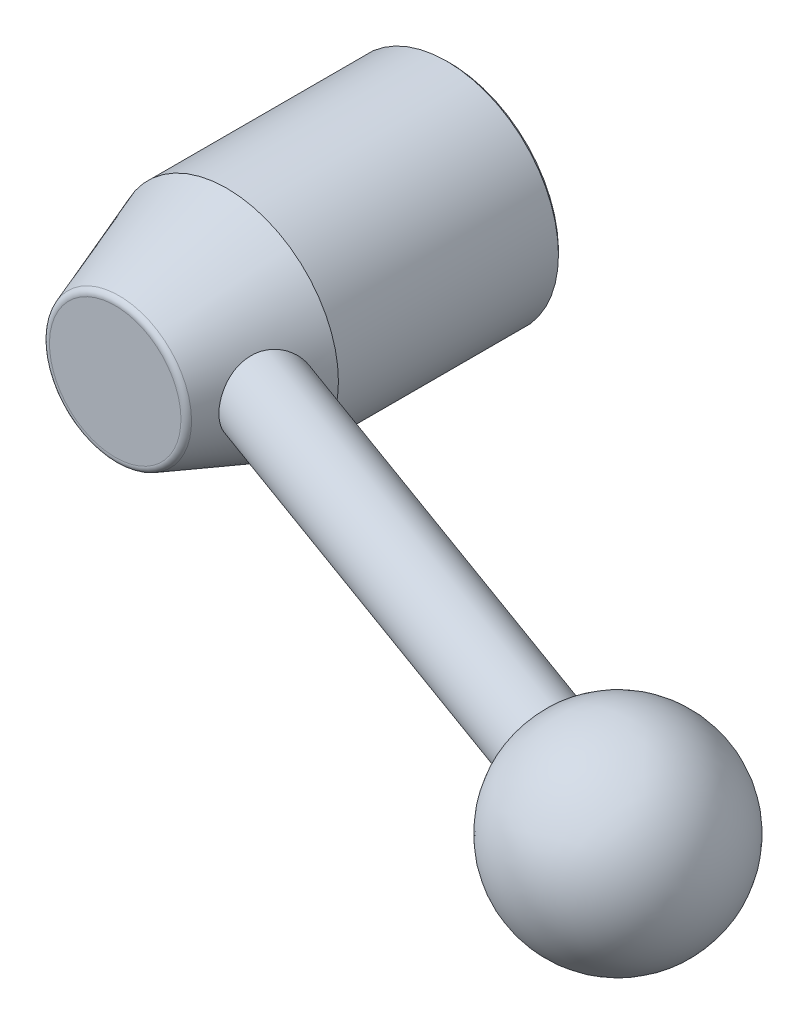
ISO-10303-21;
HEADER;
FILE_DESCRIPTION(('STEP AP214'),'2;1');
FILE_NAME('part.step','',(''),(''),'','','');
FILE_SCHEMA(('AUTOMOTIVE_DESIGN { 1 0 10303 214 1 1 1 1 }'));
ENDSEC;
DATA;
#1=APPLICATION_CONTEXT('core data for automotive mechanical design processes');
#2=APPLICATION_PROTOCOL_DEFINITION('international standard','automotive_design',2000,#1);
#3=PRODUCT_CONTEXT('',#1,'mechanical');
#4=PRODUCT('Part','Part','',(#3));
#5=PRODUCT_RELATED_PRODUCT_CATEGORY('part','',(#4));
#6=PRODUCT_DEFINITION_FORMATION('','',#4);
#7=PRODUCT_DEFINITION_CONTEXT('part definition',#1,'design');
#8=PRODUCT_DEFINITION('design','',#6,#7);
#9=PRODUCT_DEFINITION_SHAPE('','',#8);
#10=(LENGTH_UNIT() NAMED_UNIT(*) SI_UNIT(.MILLI.,.METRE.));
#11=(NAMED_UNIT(*) PLANE_ANGLE_UNIT() SI_UNIT($,.RADIAN.));
#12=(NAMED_UNIT(*) SI_UNIT($,.STERADIAN.) SOLID_ANGLE_UNIT());
#13=UNCERTAINTY_MEASURE_WITH_UNIT(LENGTH_MEASURE(1.E-05),#10,'distance_accuracy_value','');
#14=(GEOMETRIC_REPRESENTATION_CONTEXT(3) GLOBAL_UNCERTAINTY_ASSIGNED_CONTEXT((#13)) GLOBAL_UNIT_ASSIGNED_CONTEXT((#10,
#11,#12)) REPRESENTATION_CONTEXT('',''));
#15=CARTESIAN_POINT('',(0.,0.,0.));
#16=DIRECTION('',(0.,0.,1.));
#17=DIRECTION('',(1.,0.,0.));
#18=AXIS2_PLACEMENT_3D('',#15,#16,#17);
#19=CARTESIAN_POINT('',(0.,0.,35.));
#20=DIRECTION('',(0.,0.,-1.));
#21=DIRECTION('',(0.,1.,0.));
#22=AXIS2_PLACEMENT_3D('',#19,#20,#21);
#23=CONICAL_SURFACE('',#22,17.5,0.349065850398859);
#24=CARTESIAN_POINT('',(0.,0.,51.888937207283));
#25=DIRECTION('',(0.,0.,1.));
#26=DIRECTION('',(0.,-1.,0.));
#27=AXIS2_PLACEMENT_3D('',#24,#25,#26);
#28=CIRCLE('',#27,11.3529295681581);
#29=CARTESIAN_POINT('',(0.,-11.3529295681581,51.888937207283));
#30=VERTEX_POINT('',#29);
#31=EDGE_CURVE('E69',#30,#30,#28,.T.);
#32=ORIENTED_EDGE('',*,*,#31,.F.);
#33=EDGE_LOOP('',(#32));
#34=FACE_BOUND('',#33,.T.);
#35=CARTESIAN_POINT('',(0.,0.,35.));
#36=DIRECTION('',(0.,0.,1.));
#37=DIRECTION('',(0.,-1.,0.));
#38=AXIS2_PLACEMENT_3D('',#35,#36,#37);
#39=CIRCLE('',#38,17.5);
#40=CARTESIAN_POINT('',(0.,-17.5,35.));
#41=VERTEX_POINT('',#40);
#42=EDGE_CURVE('E73',#41,#41,#39,.T.);
#43=ORIENTED_EDGE('',*,*,#42,.T.);
#44=EDGE_LOOP('',(#43));
#45=FACE_BOUND('',#44,.T.);
#46=CARTESIAN_POINT('',(15.245155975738,4.63572958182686,39.3014794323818));
#47=CARTESIAN_POINT('',(15.1712199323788,4.74137319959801,39.4113874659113));
#48=CARTESIAN_POINT('',(15.0958210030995,4.84170645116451,39.5254948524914));
#49=CARTESIAN_POINT('',(14.9431119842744,5.03109548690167,39.7616169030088));
#50=CARTESIAN_POINT('',(14.8658008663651,5.12014503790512,39.8836358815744));
#51=CARTESIAN_POINT('',(14.7101507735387,5.28651534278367,40.1353238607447));
#52=CARTESIAN_POINT('',(14.631809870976,5.36380914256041,40.2650095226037));
#53=CARTESIAN_POINT('',(14.4753464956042,5.50584550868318,40.5312041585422));
#54=CARTESIAN_POINT('',(14.3972240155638,5.57058849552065,40.6677129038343));
#55=CARTESIAN_POINT('',(14.242132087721,5.68710167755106,40.9471787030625));
#56=CARTESIAN_POINT('',(14.1651650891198,5.73884720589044,41.0901474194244));
#57=CARTESIAN_POINT('',(14.0136540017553,5.82870223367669,41.3814858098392));
#58=CARTESIAN_POINT('',(13.9391090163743,5.86681683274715,41.5298534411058));
#59=CARTESIAN_POINT('',(13.7935304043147,5.9290042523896,41.8310419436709));
#60=CARTESIAN_POINT('',(13.7224940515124,5.95308813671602,41.9838592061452));
#61=CARTESIAN_POINT('',(13.5848652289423,5.98696087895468,42.2930371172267));
#62=CARTESIAN_POINT('',(13.5182724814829,5.99675063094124,42.4493975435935));
#63=CARTESIAN_POINT('',(13.3934234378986,6.00176092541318,42.757077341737));
#64=CARTESIAN_POINT('',(13.3349221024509,5.99764677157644,42.9082866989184));
#65=CARTESIAN_POINT('',(13.223370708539,5.97630736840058,43.211785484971));
#66=CARTESIAN_POINT('',(13.1703204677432,5.95908255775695,43.3640748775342));
#67=CARTESIAN_POINT('',(13.0701269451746,5.91167475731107,43.6685698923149));
#68=CARTESIAN_POINT('',(13.0229834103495,5.88149232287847,43.8207755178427));
#69=CARTESIAN_POINT('',(12.9348624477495,5.80846261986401,44.1239237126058));
#70=CARTESIAN_POINT('',(12.8938849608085,5.7656154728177,44.2748662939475));
#71=CARTESIAN_POINT('',(12.8195488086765,5.66947340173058,44.5688096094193));
#72=CARTESIAN_POINT('',(12.7859656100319,5.61661996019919,44.7118984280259));
#73=CARTESIAN_POINT('',(12.7244523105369,5.49998511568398,44.9948486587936));
#74=CARTESIAN_POINT('',(12.6965240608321,5.43620014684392,45.1347090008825));
#75=CARTESIAN_POINT('',(12.6460784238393,5.29822419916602,45.4101842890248));
#76=CARTESIAN_POINT('',(12.6235602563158,5.22403472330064,45.5457998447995));
#77=CARTESIAN_POINT('',(12.5835401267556,5.06577379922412,45.8119294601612));
#78=CARTESIAN_POINT('',(12.5660399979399,4.98169875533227,45.9424416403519));
#79=CARTESIAN_POINT('',(12.5187517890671,4.70590737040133,46.3387324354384));
#80=CARTESIAN_POINT('',(12.4967868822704,4.49800371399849,46.5944286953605));
#81=CARTESIAN_POINT('',(12.4678553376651,4.04551385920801,47.0721305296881));
#82=CARTESIAN_POINT('',(12.4608961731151,3.80090944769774,47.2941192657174));
#83=CARTESIAN_POINT('',(12.4573418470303,3.40188248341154,47.6032310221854));
#84=CARTESIAN_POINT('',(12.4574268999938,3.25860175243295,47.7049695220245));
#85=CARTESIAN_POINT('',(12.4594032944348,2.96392471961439,47.8958571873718));
#86=CARTESIAN_POINT('',(12.4612939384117,2.81253157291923,47.9850111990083));
#87=CARTESIAN_POINT('',(12.4660904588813,2.50255104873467,48.1497242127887));
#88=CARTESIAN_POINT('',(12.4689962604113,2.34396420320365,48.2252842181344));
#89=CARTESIAN_POINT('',(12.475106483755,2.02064347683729,48.3618522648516));
#90=CARTESIAN_POINT('',(12.47831088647,1.85590998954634,48.422861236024));
#91=CARTESIAN_POINT('',(12.4842930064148,1.52759312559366,48.5275172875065));
#92=CARTESIAN_POINT('',(12.4870819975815,1.36418549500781,48.5717147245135));
#93=CARTESIAN_POINT('',(12.4919314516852,1.03402332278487,48.6451424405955));
#94=CARTESIAN_POINT('',(12.4939919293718,0.867268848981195,48.6743730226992));
#95=CARTESIAN_POINT('',(12.4970842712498,0.53185068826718,48.7173991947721));
#96=CARTESIAN_POINT('',(12.4981166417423,0.363187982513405,48.7312023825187));
#97=CARTESIAN_POINT('',(12.4990096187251,0.0253097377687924,48.7431733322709));
#98=CARTESIAN_POINT('',(12.4988702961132,-0.14390576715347,48.7413420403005));
#99=CARTESIAN_POINT('',(12.4974969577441,-0.468147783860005,48.7228380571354));
#100=CARTESIAN_POINT('',(12.4963499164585,-0.62324335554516,48.7073441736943));
#101=CARTESIAN_POINT('',(12.4932167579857,-0.931618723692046,48.6633224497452));
#102=CARTESIAN_POINT('',(12.4912303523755,-1.0848978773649,48.6347901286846));
#103=CARTESIAN_POINT('',(12.4866657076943,-1.38848808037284,48.5650759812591));
#104=CARTESIAN_POINT('',(12.4840876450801,-1.53880000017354,48.5238979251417));
#105=CARTESIAN_POINT('',(12.4786820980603,-1.83560019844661,48.4293818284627));
#106=CARTESIAN_POINT('',(12.4758545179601,-1.98208698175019,48.3760391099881));
#107=CARTESIAN_POINT('',(12.4703450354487,-2.27191844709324,48.2571495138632));
#108=CARTESIAN_POINT('',(12.4676650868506,-2.41521055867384,48.191474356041));
#109=CARTESIAN_POINT('',(12.4629932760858,-2.69618875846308,48.0490061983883));
#110=CARTESIAN_POINT('',(12.4610016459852,-2.83387294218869,47.9722094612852));
#111=CARTESIAN_POINT('',(12.4568880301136,-3.2374188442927,47.7262238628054));
#112=CARTESIAN_POINT('',(12.4566232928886,-3.49392764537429,47.5413757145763));
#113=CARTESIAN_POINT('',(12.4663248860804,-3.9968596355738,47.1191228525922));
#114=CARTESIAN_POINT('',(12.4771413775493,-4.24068294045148,46.8786311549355));
#115=CARTESIAN_POINT('',(12.5067171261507,-4.57564343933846,46.4925311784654));
#116=CARTESIAN_POINT('',(12.5188130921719,-4.6822271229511,46.3595093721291));
#117=CARTESIAN_POINT('',(12.5481926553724,-4.88446771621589,46.0859717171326));
#118=CARTESIAN_POINT('',(12.5654741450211,-4.98012904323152,45.9454589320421));
#119=CARTESIAN_POINT('',(12.6064120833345,-5.16218732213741,45.6542270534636));
#120=CARTESIAN_POINT('',(12.6302235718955,-5.24827619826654,45.5033370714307));
#121=CARTESIAN_POINT('',(12.6845676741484,-5.40743700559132,45.1960715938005));
#122=CARTESIAN_POINT('',(12.7150974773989,-5.48051435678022,45.0396984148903));
#123=CARTESIAN_POINT('',(12.7832627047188,-5.61294727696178,44.7228071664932));
#124=CARTESIAN_POINT('',(12.8208955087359,-5.67230788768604,44.5622906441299));
#125=CARTESIAN_POINT('',(12.9034340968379,-5.77669680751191,44.2384927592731));
#126=CARTESIAN_POINT('',(12.9483392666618,-5.82172632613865,44.0752116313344));
#127=CARTESIAN_POINT('',(13.0418570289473,-5.89426294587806,43.7590678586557));
#128=CARTESIAN_POINT('',(13.0899767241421,-5.92279078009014,43.6062927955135));
#129=CARTESIAN_POINT('',(13.1921050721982,-5.96677510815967,43.3008315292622));
#130=CARTESIAN_POINT('',(13.2461134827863,-5.98223213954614,43.148145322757));
#131=CARTESIAN_POINT('',(13.3595308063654,-5.999942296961,42.844036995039));
#132=CARTESIAN_POINT('',(13.4189392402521,-6.00219659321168,42.692614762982));
#133=CARTESIAN_POINT('',(13.5425113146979,-5.99352015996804,42.3921099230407));
#134=CARTESIAN_POINT('',(13.6066749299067,-5.9825895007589,42.243027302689));
#135=CARTESIAN_POINT('',(13.7363795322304,-5.94838153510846,41.9539803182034));
#136=CARTESIAN_POINT('',(13.8017678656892,-5.92560514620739,41.8138876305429));
#137=CARTESIAN_POINT('',(13.9354637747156,-5.86825000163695,41.5375108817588));
#138=CARTESIAN_POINT('',(14.0037722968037,-5.83366739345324,41.4012280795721));
#139=CARTESIAN_POINT('',(14.1424552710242,-5.75302272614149,41.1332301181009));
#140=CARTESIAN_POINT('',(14.2128292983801,-5.70696301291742,41.0015140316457));
#141=CARTESIAN_POINT('',(14.354843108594,-5.6037116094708,40.7431631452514));
#142=CARTESIAN_POINT('',(14.4264833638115,-5.54651568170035,40.6165303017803));
#143=CARTESIAN_POINT('',(14.573732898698,-5.41830107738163,40.3627564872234));
#144=CARTESIAN_POINT('',(14.6493625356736,-5.3467368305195,40.2359028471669));
#145=CARTESIAN_POINT('',(14.8001200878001,-5.19228550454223,39.98890216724));
#146=CARTESIAN_POINT('',(14.8752478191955,-5.10939449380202,39.8687574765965));
#147=CARTESIAN_POINT('',(15.0240416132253,-4.93282986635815,39.6356773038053));
#148=CARTESIAN_POINT('',(15.0977074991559,-4.83915495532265,39.5227426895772));
#149=CARTESIAN_POINT('',(15.2426510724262,-4.64158880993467,39.3045352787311));
#150=CARTESIAN_POINT('',(15.313928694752,-4.53769729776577,39.1992626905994));
#151=CARTESIAN_POINT('',(15.4572232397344,-4.31401509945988,38.9909592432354));
#152=CARTESIAN_POINT('',(15.5290459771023,-4.19365315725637,38.8884073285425));
#153=CARTESIAN_POINT('',(15.667987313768,-3.94294608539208,38.6928606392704));
#154=CARTESIAN_POINT('',(15.735107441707,-3.81260422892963,38.5998627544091));
#155=CARTESIAN_POINT('',(15.8637305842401,-3.54265269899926,38.4238228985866));
#156=CARTESIAN_POINT('',(15.9252312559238,-3.40303920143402,38.3407850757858));
#157=CARTESIAN_POINT('',(16.0416450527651,-3.11554293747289,38.1852119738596));
#158=CARTESIAN_POINT('',(16.0965609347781,-2.96766366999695,38.1126722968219));
#159=CARTESIAN_POINT('',(16.1987517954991,-2.66526900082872,37.9788176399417));
#160=CARTESIAN_POINT('',(16.2460610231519,-2.51078754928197,37.9174521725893));
#161=CARTESIAN_POINT('',(16.3325771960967,-2.19568796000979,37.8059735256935));
#162=CARTESIAN_POINT('',(16.3717873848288,-2.03507230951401,37.7558558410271));
#163=CARTESIAN_POINT('',(16.4414816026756,-1.7088339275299,37.6672162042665));
#164=CARTESIAN_POINT('',(16.4719662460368,-1.54321154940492,37.6286934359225));
#165=CARTESIAN_POINT('',(16.5236931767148,-1.20822625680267,37.5635471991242));
#166=CARTESIAN_POINT('',(16.5449358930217,-1.0388635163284,37.5369231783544));
#167=CARTESIAN_POINT('',(16.5770158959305,-0.705995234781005,37.4967896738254));
#168=CARTESIAN_POINT('',(16.5883062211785,-0.54260191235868,37.4827088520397));
#169=CARTESIAN_POINT('',(16.6020015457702,-0.214867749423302,37.4656349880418));
#170=CARTESIAN_POINT('',(16.6044068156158,-0.0505269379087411,37.4626416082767));
#171=CARTESIAN_POINT('',(16.6002937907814,0.277825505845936,37.4677655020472));
#172=CARTESIAN_POINT('',(16.5937778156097,0.441837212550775,37.4758798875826));
#173=CARTESIAN_POINT('',(16.5719317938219,0.768346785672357,37.5031495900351));
#174=CARTESIAN_POINT('',(16.5566018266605,0.930844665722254,37.5223048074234));
#175=CARTESIAN_POINT('',(16.5178839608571,1.24893849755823,37.5708663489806));
#176=CARTESIAN_POINT('',(16.4947158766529,1.40460406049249,37.5999932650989));
#177=CARTESIAN_POINT('',(16.4405864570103,1.71236583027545,37.6683845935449));
#178=CARTESIAN_POINT('',(16.4096224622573,1.86446079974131,37.7076524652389));
#179=CARTESIAN_POINT('',(16.3403426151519,2.16408097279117,37.7960713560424));
#180=CARTESIAN_POINT('',(16.3020245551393,2.31160478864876,37.8452253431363));
#181=CARTESIAN_POINT('',(16.2185654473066,2.60116898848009,37.9531206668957));
#182=CARTESIAN_POINT('',(16.173422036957,2.74320745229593,38.0118653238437));
#183=CARTESIAN_POINT('',(16.0756178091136,3.02469233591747,38.1403193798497));
#184=CARTESIAN_POINT('',(16.0227857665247,3.16396285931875,38.21028378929));
#185=CARTESIAN_POINT('',(15.9113019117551,3.43495292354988,38.3595765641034));
#186=CARTESIAN_POINT('',(15.8526499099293,3.56667221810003,38.4389052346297));
#187=CARTESIAN_POINT('',(15.730430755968,3.82155136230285,38.6063580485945));
#188=CARTESIAN_POINT('',(15.6668733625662,3.94472732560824,38.6944648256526));
#189=CARTESIAN_POINT('',(15.5355844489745,4.18207455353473,38.8791701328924));
#190=CARTESIAN_POINT('',(15.4678551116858,4.29625045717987,38.9757642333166));
#191=CARTESIAN_POINT('',(15.3733311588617,4.44523979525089,39.1128510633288));
#192=CARTESIAN_POINT('',(15.3479698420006,4.48423981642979,39.1498467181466));
#193=CARTESIAN_POINT('',(15.2968510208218,4.56095426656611,39.2248824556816));
#194=CARTESIAN_POINT('',(15.2710935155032,4.59866869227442,39.262922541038));
#195=CARTESIAN_POINT('',(15.245155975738,4.63572958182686,39.3014794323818));
#196=B_SPLINE_CURVE_WITH_KNOTS('',3,(#46,#47,#48,#49,#50,#51,#52,#53,#54,#55,#56,#57,#58,#59,
#60,#61,#62,#63,#64,#65,#66,#67,#68,#69,#70,#71,#72,#73,#74,#75,#76,#77,#78,#79,#80,#81,#82,#83,
#84,#85,#86,#87,#88,#89,#90,#91,#92,#93,#94,#95,#96,#97,#98,#99,#100,#101,#102,#103,#104,#105,
#106,#107,#108,#109,#110,#111,#112,#113,#114,#115,#116,#117,#118,#119,#120,#121,#122,#123,#124,
#125,#126,#127,#128,#129,#130,#131,#132,#133,#134,#135,#136,#137,#138,#139,#140,#141,#142,#143,
#144,#145,#146,#147,#148,#149,#150,#151,#152,#153,#154,#155,#156,#157,#158,#159,#160,#161,#162,
#163,#164,#165,#166,#167,#168,#169,#170,#171,#172,#173,#174,#175,#176,#177,#178,#179,#180,#181,
#182,#183,#184,#185,#186,#187,#188,#189,#190,#191,#192,#193,#194,#195),.UNSPECIFIED.,.T.,.F.,(4,
2,2,2,2,2,2,2,2,2,2,2,2,2,2,2,2,2,2,2,2,2,2,2,2,2,2,2,2,2,2,2,2,2,2,2,2,2,2,2,2,2,2,2,2,2,2,2,2,
2,2,2,2,2,2,2,2,2,2,2,2,2,2,2,2,2,2,2,2,2,2,2,2,2,4),(0.,0.508240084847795,1.01675971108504,
1.52642826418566,2.036079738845,2.54669125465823,3.05711153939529,3.56712879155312,
4.07711414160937,4.56304885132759,5.04896730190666,5.53486492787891,6.02075789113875,
6.4888064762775,6.95700803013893,7.42514201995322,7.89344681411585,8.87981827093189,
9.86668085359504,10.3933129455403,10.9197416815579,11.4461315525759,11.9724877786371,
12.4797164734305,12.986934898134,13.4939034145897,14.0008412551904,14.4679016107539,
14.9351225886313,15.4022044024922,15.8694661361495,16.3418884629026,16.8144699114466,
17.7591387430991,18.7821377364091,19.2943035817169,19.8062615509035,20.3316214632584,
20.8567620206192,21.3817092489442,21.9066121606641,22.3940752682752,22.8815183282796,
23.3689181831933,23.8563154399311,24.3246018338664,24.7930411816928,25.2613848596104,
25.7299071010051,26.22170676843,26.7136775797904,27.2057075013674,27.6977508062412,
28.2181546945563,28.7383886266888,29.2588384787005,29.7790696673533,30.2968886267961,
30.8144998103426,31.3320745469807,31.8496252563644,32.3421774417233,32.8347146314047,
33.327123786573,33.8195285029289,34.2991337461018,34.7789028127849,35.2588161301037,
35.738895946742,36.2320482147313,36.725216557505,37.2174279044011,37.7093838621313,
37.8876793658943,38.0659753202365),.UNSPECIFIED.);
#197=CARTESIAN_POINT('',(15.245155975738,4.63572958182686,39.3014794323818));
#198=VERTEX_POINT('',#197);
#199=EDGE_CURVE('E23',#198,#198,#196,.T.);
#200=ORIENTED_EDGE('',*,*,#199,.F.);
#201=EDGE_LOOP('',(#200));
#202=FACE_BOUND('',#201,.T.);
#203=ADVANCED_FACE('F12',(#34,#45,#202),#23,.T.);
#204=CARTESIAN_POINT('',(0.,0.,59.2286386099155));
#205=DIRECTION('',(0.,0.,1.));
#206=DIRECTION('',(0.,-1.,0.));
#207=AXIS2_PLACEMENT_3D('',#204,#205,#206);
#208=CYLINDRICAL_SURFACE('',#207,17.5);
#209=CARTESIAN_POINT('',(0.,0.,0.5));
#210=DIRECTION('',(0.,0.,1.));
#211=DIRECTION('',(0.,-1.,0.));
#212=AXIS2_PLACEMENT_3D('',#209,#210,#211);
#213=CIRCLE('',#212,17.5);
#214=CARTESIAN_POINT('',(0.,-17.5,0.5));
#215=VERTEX_POINT('',#214);
#216=EDGE_CURVE('E27',#215,#215,#213,.T.);
#217=ORIENTED_EDGE('',*,*,#216,.T.);
#218=EDGE_LOOP('',(#217));
#219=FACE_BOUND('',#218,.T.);
#220=ORIENTED_EDGE('',*,*,#42,.F.);
#221=EDGE_LOOP('',(#220));
#222=FACE_BOUND('',#221,.T.);
#223=ADVANCED_FACE('F58',(#219,#222),#208,.T.);
#224=CARTESIAN_POINT('',(0.,0.,0.5));
#225=DIRECTION('',(0.,0.,1.));
#226=DIRECTION('',(0.,-1.,0.));
#227=AXIS2_PLACEMENT_3D('',#224,#225,#226);
#228=CONICAL_SURFACE('',#227,17.5,0.785398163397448);
#229=CARTESIAN_POINT('',(0.,0.,0.));
#230=DIRECTION('',(0.,0.,1.));
#231=DIRECTION('',(0.,-1.,0.));
#232=AXIS2_PLACEMENT_3D('',#229,#230,#231);
#233=CIRCLE('',#232,17.);
#234=CARTESIAN_POINT('',(0.,-17.,0.));
#235=VERTEX_POINT('',#234);
#236=EDGE_CURVE('E87',#235,#235,#233,.T.);
#237=ORIENTED_EDGE('',*,*,#236,.T.);
#238=EDGE_LOOP('',(#237));
#239=FACE_BOUND('',#238,.T.);
#240=ORIENTED_EDGE('',*,*,#216,.F.);
#241=EDGE_LOOP('',(#240));
#242=FACE_BOUND('',#241,.T.);
#243=ADVANCED_FACE('F64',(#239,#242),#228,.T.);
#244=CARTESIAN_POINT('',(-17.,0.,0.));
#245=DIRECTION('',(0.,0.,-1.));
#246=DIRECTION('',(0.,1.,0.));
#247=AXIS2_PLACEMENT_3D('',#244,#245,#246);
#248=PLANE('',#247);
#249=CARTESIAN_POINT('',(0.,0.,0.));
#250=DIRECTION('',(0.,0.,-1.));
#251=DIRECTION('',(-1.,0.,0.));
#252=AXIS2_PLACEMENT_3D('',#249,#250,#251);
#253=CIRCLE('',#252,8.5);
#254=CARTESIAN_POINT('',(-8.5,0.,0.));
#255=VERTEX_POINT('',#254);
#256=EDGE_CURVE('E8',#255,#255,#253,.F.);
#257=ORIENTED_EDGE('',*,*,#256,.T.);
#258=EDGE_LOOP('',(#257));
#259=FACE_BOUND('',#258,.T.);
#260=ORIENTED_EDGE('',*,*,#236,.F.);
#261=EDGE_LOOP('',(#260));
#262=FACE_BOUND('',#261,.T.);
#263=ADVANCED_FACE('F96',(#259,#262),#248,.T.);
#264=CARTESIAN_POINT('',(-10.3046768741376,0.,52.5));
#265=DIRECTION('',(0.,0.,-1.));
#266=DIRECTION('',(0.,1.,0.));
#267=AXIS2_PLACEMENT_3D('',#264,#265,#266);
#268=PLANE('',#267);
#269=CARTESIAN_POINT('',(0.,0.,52.5));
#270=DIRECTION('',(0.,0.,1.));
#271=DIRECTION('',(0.,-1.,0.));
#272=AXIS2_PLACEMENT_3D('',#269,#270,#271);
#273=CIRCLE('',#272,10.3046768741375);
#274=CARTESIAN_POINT('',(0.,-10.3046768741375,52.5));
#275=VERTEX_POINT('',#274);
#276=EDGE_CURVE('E85',#275,#275,#273,.T.);
#277=ORIENTED_EDGE('',*,*,#276,.T.);
#278=EDGE_LOOP('',(#277));
#279=FACE_BOUND('',#278,.T.);
#280=ADVANCED_FACE('F102',(#279),#268,.F.);
#281=CARTESIAN_POINT('',(0.,0.,51.5076902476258));
#282=DIRECTION('',(0.,0.,1.));
#283=DIRECTION('',(0.,-1.,0.));
#284=AXIS2_PLACEMENT_3D('',#281,#282,#283);
#285=TOROIDAL_SURFACE('',#284,10.4284563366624,1.);
#286=ORIENTED_EDGE('',*,*,#31,.T.);
#287=EDGE_LOOP('',(#286));
#288=FACE_BOUND('',#287,.T.);
#289=ORIENTED_EDGE('',*,*,#276,.F.);
#290=EDGE_LOOP('',(#289));
#291=FACE_BOUND('',#290,.T.);
#292=ADVANCED_FACE('F44',(#288,#291),#285,.T.);
#293=CARTESIAN_POINT('',(124.590115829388,0.,83.153456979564));
#294=DIRECTION('',(0.939692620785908,0.,0.342020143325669));
#295=DIRECTION('',(-0.342020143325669,0.,0.939692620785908));
#296=AXIS2_PLACEMENT_3D('',#293,#294,#295);
#297=CYLINDRICAL_SURFACE('',#296,6.);
#298=ORIENTED_EDGE('',*,*,#199,.T.);
#299=EDGE_LOOP('',(#298));
#300=FACE_BOUND('',#299,.T.);
#301=CARTESIAN_POINT('',(86.8770441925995,0.,69.427021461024));
#302=DIRECTION('',(0.939692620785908,0.,0.342020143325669));
#303=DIRECTION('',(-0.342020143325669,0.,0.939692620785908));
#304=AXIS2_PLACEMENT_3D('',#301,#302,#303);
#305=CIRCLE('',#304,6.);
#306=CARTESIAN_POINT('',(84.8249233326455,0.,75.0651771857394));
#307=VERTEX_POINT('',#306);
#308=EDGE_CURVE('E77',#307,#307,#305,.T.);
#309=ORIENTED_EDGE('',*,*,#308,.F.);
#310=EDGE_LOOP('',(#309));
#311=FACE_BOUND('',#310,.T.);
#312=ADVANCED_FACE('F39',(#300,#311),#297,.T.);
#313=CARTESIAN_POINT('',(100.814938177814,0.,74.5));
#314=DIRECTION('',(0.,-1.,0.));
#315=DIRECTION('',(1.,0.,0.));
#316=AXIS2_PLACEMENT_3D('',#313,#314,#315);
#317=SPHERICAL_SURFACE('',#316,16.);
#318=CARTESIAN_POINT('',(100.814938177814,0.,74.5));
#319=DIRECTION('',(0.939692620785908,0.,0.342020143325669));
#320=DIRECTION('',(-0.342020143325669,0.,0.939692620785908));
#321=AXIS2_PLACEMENT_3D('',#318,#319,#320);
#322=SPHERICAL_SURFACE('',#321,16.);
#323=ORIENTED_EDGE('',*,*,#308,.T.);
#324=EDGE_LOOP('',(#323));
#325=FACE_BOUND('',#324,.T.);
#326=ADVANCED_FACE('F43',(#325),#322,.T.);
#327=CARTESIAN_POINT('',(0.,0.,25.));
#328=DIRECTION('',(0.,0.,-1.));
#329=DIRECTION('',(-1.,0.,0.));
#330=AXIS2_PLACEMENT_3D('',#327,#328,#329);
#331=CYLINDRICAL_SURFACE('',#330,8.);
#332=CARTESIAN_POINT('',(0.,0.,0.500000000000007));
#333=DIRECTION('',(0.,0.,-1.));
#334=DIRECTION('',(-1.,0.,0.));
#335=AXIS2_PLACEMENT_3D('',#332,#333,#334);
#336=CIRCLE('',#335,8.);
#337=CARTESIAN_POINT('',(-8.,0.,0.500000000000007));
#338=VERTEX_POINT('',#337);
#339=EDGE_CURVE('E19',#338,#338,#336,.T.);
#340=ORIENTED_EDGE('',*,*,#339,.T.);
#341=EDGE_LOOP('',(#340));
#342=FACE_BOUND('',#341,.T.);
#343=CARTESIAN_POINT('',(0.,0.,25.));
#344=DIRECTION('',(0.,0.,-1.));
#345=DIRECTION('',(-1.,0.,0.));
#346=AXIS2_PLACEMENT_3D('',#343,#344,#345);
#347=CIRCLE('',#346,8.);
#348=CARTESIAN_POINT('',(-8.,0.,25.));
#349=VERTEX_POINT('',#348);
#350=EDGE_CURVE('E78',#349,#349,#347,.T.);
#351=ORIENTED_EDGE('',*,*,#350,.F.);
#352=EDGE_LOOP('',(#351));
#353=FACE_BOUND('',#352,.T.);
#354=ADVANCED_FACE('F46',(#342,#353),#331,.F.);
#355=CARTESIAN_POINT('',(0.,0.,25.));
#356=DIRECTION('',(0.,0.,-1.));
#357=DIRECTION('',(-1.,0.,0.));
#358=AXIS2_PLACEMENT_3D('',#355,#356,#357);
#359=PLANE('',#358);
#360=ORIENTED_EDGE('',*,*,#350,.T.);
#361=EDGE_LOOP('',(#360));
#362=FACE_BOUND('',#361,.T.);
#363=ADVANCED_FACE('F55',(#362),#359,.T.);
#364=CARTESIAN_POINT('',(0.,0.,0.500000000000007));
#365=DIRECTION('',(0.,0.,-1.));
#366=DIRECTION('',(-1.,0.,0.));
#367=AXIS2_PLACEMENT_3D('',#364,#365,#366);
#368=CONICAL_SURFACE('',#367,8.,0.785398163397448);
#369=ORIENTED_EDGE('',*,*,#256,.F.);
#370=EDGE_LOOP('',(#369));
#371=FACE_BOUND('',#370,.T.);
#372=ORIENTED_EDGE('',*,*,#339,.F.);
#373=EDGE_LOOP('',(#372));
#374=FACE_BOUND('',#373,.T.);
#375=ADVANCED_FACE('F14',(#371,#374),#368,.F.);
#376=CLOSED_SHELL('',(#203,#223,#243,#263,#280,#292,#312,#326,#354,#363,#375));
#377=MANIFOLD_SOLID_BREP('B1',#376);
#378=ADVANCED_BREP_SHAPE_REPRESENTATION('',(#18,#377),#14);
#379=SHAPE_DEFINITION_REPRESENTATION(#9,#378);
ENDSEC;
END-ISO-10303-21;
